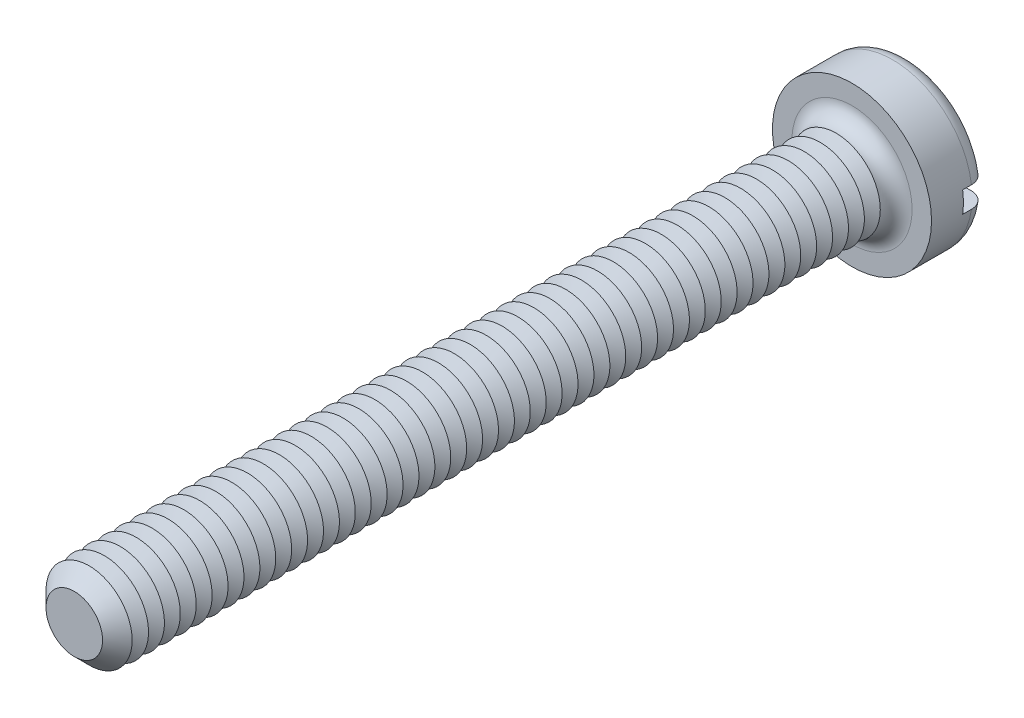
from build123d import *

# Parameters (mm, degrees)
SKETCH3_R           = 2.25
BOSS_EXTRUDE2_DEPTH = 1.6
SKETCH4_R           = 1.25
BOSS_EXTRUDE3_DEPTH = 22
FILLET1_R           = 0.45
CHAMFER1_SIZE       = 0.45
LPATTERN1_COUNT     = 47
LPATTERN1_PITCH     = 0.45
SKETCH8_W           = 4.5
SKETCH8_H           = 0.6
CUT_EXTRUDE1_DEPTH  = 0.7


with BuildPart() as part:
    # Sketch3 → Boss-Extrude2 (new body)
    with BuildSketch(Plane.XY):
        Circle(SKETCH3_R)
    extrude(amount=-BOSS_EXTRUDE2_DEPTH)

    # Sketch4 → Boss-Extrude3 (add)
    with BuildSketch(Plane.XY):
        Circle(SKETCH4_R)
    extrude(amount=BOSS_EXTRUDE3_DEPTH)

    # Fillet1
    fillet1_edges = [part.edges().sort_by_distance(p)[0] for p in [
        (-2.25, 0, -1.6),
        (-1.25, 0, 0),
    ]]
    fillet(fillet1_edges, radius=FILLET1_R)

    # Chamfer1
    chamfer1_edges = [part.edges().sort_by_distance(p)[0] for p in [
        (-1.25, 0, 22),
    ]]
    chamfer(chamfer1_edges, length=CHAMFER1_SIZE)

    # Sketch6 → Cut-Revolve1 (revolve, cut)
    with BuildSketch(Plane(origin=(0, 0, 0), x_dir=(0, 0, -1), z_dir=(1, 0, 0)), mode=Mode.PRIVATE) as cut_revolve1_sk:
        Polygon((-0.45, 1.25), (-0.675, 0.860288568), (-0.9, 1.25), align=None)
    cut_revolve1 = revolve(cut_revolve1_sk.sketch.rotate(Axis((0, 0, -1.694361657), (0, 0, 1)), 90), axis=Axis((0, 0, -1.694361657), (0, 0, 1)), mode=Mode.SUBTRACT)

    # LPattern1: Cut-Revolve1 ×47
    with Locations(*[(0, 0, i * LPATTERN1_PITCH) for i in range(1, LPATTERN1_COUNT)]):
        add(cut_revolve1, mode=Mode.SUBTRACT)

    # Sketch8 → Cut-Extrude1 (cut)
    with BuildSketch(Plane(origin=(0, 0, -1.6), x_dir=(-1, 0, 0), z_dir=(0, 0, -1))):
        Rectangle(SKETCH8_W, SKETCH8_H)
    extrude(amount=-CUT_EXTRUDE1_DEPTH, mode=Mode.SUBTRACT)


solid = part.part
